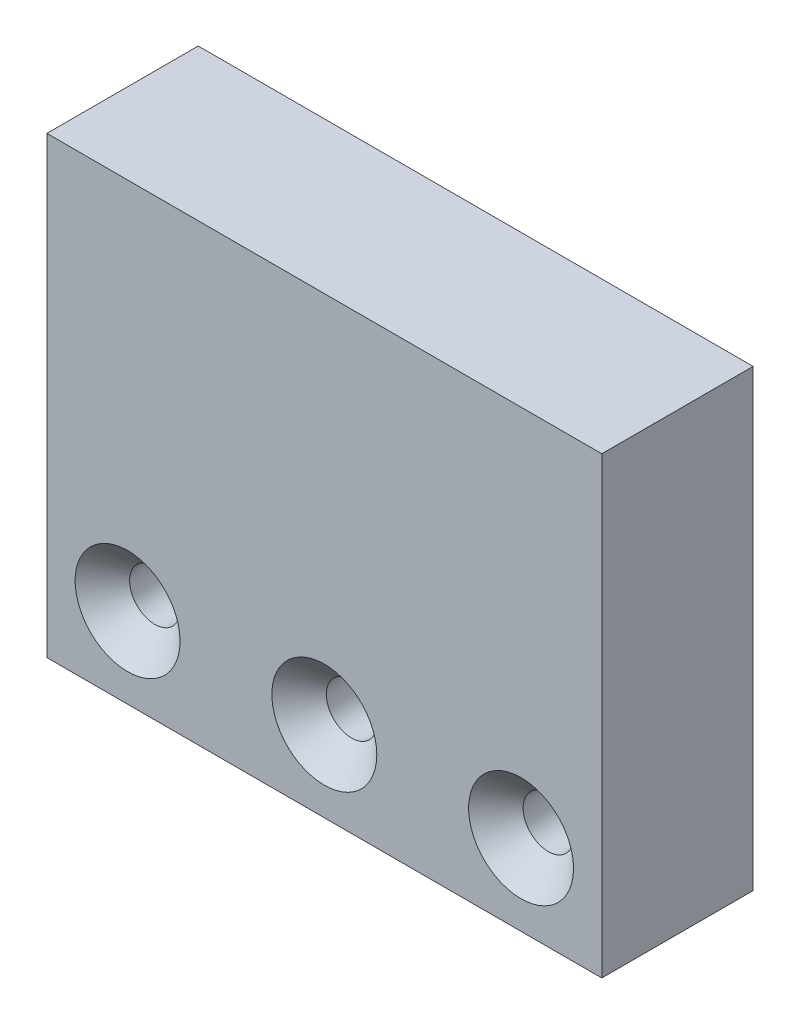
ISO-10303-21;
HEADER;
FILE_DESCRIPTION(('STEP AP214'),'2;1');
FILE_NAME('part.step','',(''),(''),'','','');
FILE_SCHEMA(('AUTOMOTIVE_DESIGN { 1 0 10303 214 1 1 1 1 }'));
ENDSEC;
DATA;
#1=APPLICATION_CONTEXT('core data for automotive mechanical design processes');
#2=APPLICATION_PROTOCOL_DEFINITION('international standard','automotive_design',2000,#1);
#3=PRODUCT_CONTEXT('',#1,'mechanical');
#4=PRODUCT('Part','Part','',(#3));
#5=PRODUCT_RELATED_PRODUCT_CATEGORY('part','',(#4));
#6=PRODUCT_DEFINITION_FORMATION('','',#4);
#7=PRODUCT_DEFINITION_CONTEXT('part definition',#1,'design');
#8=PRODUCT_DEFINITION('design','',#6,#7);
#9=PRODUCT_DEFINITION_SHAPE('','',#8);
#10=(LENGTH_UNIT() NAMED_UNIT(*) SI_UNIT(.MILLI.,.METRE.));
#11=(NAMED_UNIT(*) PLANE_ANGLE_UNIT() SI_UNIT($,.RADIAN.));
#12=(NAMED_UNIT(*) SI_UNIT($,.STERADIAN.) SOLID_ANGLE_UNIT());
#13=UNCERTAINTY_MEASURE_WITH_UNIT(LENGTH_MEASURE(1.E-05),#10,'distance_accuracy_value','');
#14=(GEOMETRIC_REPRESENTATION_CONTEXT(3) GLOBAL_UNCERTAINTY_ASSIGNED_CONTEXT((#13)) GLOBAL_UNIT_ASSIGNED_CONTEXT((#10,
#11,#12)) REPRESENTATION_CONTEXT('',''));
#15=CARTESIAN_POINT('',(0.,0.,0.));
#16=DIRECTION('',(0.,0.,1.));
#17=DIRECTION('',(1.,0.,0.));
#18=AXIS2_PLACEMENT_3D('',#15,#16,#17);
#19=CARTESIAN_POINT('',(27.5,-22.5,15.));
#20=DIRECTION('',(-1.,0.,0.));
#21=DIRECTION('',(0.,0.,1.));
#22=AXIS2_PLACEMENT_3D('',#19,#20,#21);
#23=PLANE('',#22);
#24=DIRECTION('',(0.,1.,0.));
#25=VECTOR('',#24,1.);
#26=CARTESIAN_POINT('',(27.5,-22.5,0.));
#27=LINE('',#26,#25);
#28=CARTESIAN_POINT('',(27.5,-22.5,0.));
#29=VERTEX_POINT('',#28);
#30=CARTESIAN_POINT('',(27.5,22.5,0.));
#31=VERTEX_POINT('',#30);
#32=EDGE_CURVE('E115',#29,#31,#27,.T.);
#33=ORIENTED_EDGE('',*,*,#32,.T.);
#34=DIRECTION('',(0.,0.,-1.));
#35=VECTOR('',#34,1.);
#36=CARTESIAN_POINT('',(27.5,22.5,15.));
#37=LINE('',#36,#35);
#38=CARTESIAN_POINT('',(27.5,22.5,15.));
#39=VERTEX_POINT('',#38);
#40=EDGE_CURVE('E11',#39,#31,#37,.T.);
#41=ORIENTED_EDGE('',*,*,#40,.F.);
#42=DIRECTION('',(0.,1.,0.));
#43=VECTOR('',#42,1.);
#44=CARTESIAN_POINT('',(27.5,-22.5,15.));
#45=LINE('',#44,#43);
#46=CARTESIAN_POINT('',(27.5,-22.5,15.));
#47=VERTEX_POINT('',#46);
#48=EDGE_CURVE('E116',#47,#39,#45,.T.);
#49=ORIENTED_EDGE('',*,*,#48,.F.);
#50=DIRECTION('',(0.,0.,-1.));
#51=VECTOR('',#50,1.);
#52=CARTESIAN_POINT('',(27.5,-22.5,15.));
#53=LINE('',#52,#51);
#54=EDGE_CURVE('E122',#47,#29,#53,.T.);
#55=ORIENTED_EDGE('',*,*,#54,.T.);
#56=EDGE_LOOP('',(#33,#41,#49,#55));
#57=FACE_BOUND('',#56,.T.);
#58=ADVANCED_FACE('F38',(#57),#23,.F.);
#59=CARTESIAN_POINT('',(-27.5,22.5,15.));
#60=DIRECTION('',(0.,-1.,0.));
#61=DIRECTION('',(0.,0.,-1.));
#62=AXIS2_PLACEMENT_3D('',#59,#60,#61);
#63=PLANE('',#62);
#64=DIRECTION('',(-1.,0.,0.));
#65=VECTOR('',#64,1.);
#66=CARTESIAN_POINT('',(-27.5,22.5,0.));
#67=LINE('',#66,#65);
#68=CARTESIAN_POINT('',(-27.5,22.5,0.));
#69=VERTEX_POINT('',#68);
#70=EDGE_CURVE('E125',#31,#69,#67,.T.);
#71=ORIENTED_EDGE('',*,*,#70,.T.);
#72=DIRECTION('',(0.,0.,-1.));
#73=VECTOR('',#72,1.);
#74=CARTESIAN_POINT('',(-27.5,22.5,15.));
#75=LINE('',#74,#73);
#76=CARTESIAN_POINT('',(-27.5,22.5,15.));
#77=VERTEX_POINT('',#76);
#78=EDGE_CURVE('E46',#77,#69,#75,.T.);
#79=ORIENTED_EDGE('',*,*,#78,.F.);
#80=DIRECTION('',(-1.,0.,0.));
#81=VECTOR('',#80,1.);
#82=CARTESIAN_POINT('',(-27.5,22.5,15.));
#83=LINE('',#82,#81);
#84=EDGE_CURVE('E85',#39,#77,#83,.T.);
#85=ORIENTED_EDGE('',*,*,#84,.F.);
#86=ORIENTED_EDGE('',*,*,#40,.T.);
#87=EDGE_LOOP('',(#71,#79,#85,#86));
#88=FACE_BOUND('',#87,.T.);
#89=ADVANCED_FACE('F149',(#88),#63,.F.);
#90=CARTESIAN_POINT('',(-27.5,-22.5,15.));
#91=DIRECTION('',(1.,0.,0.));
#92=DIRECTION('',(0.,0.,-1.));
#93=AXIS2_PLACEMENT_3D('',#90,#91,#92);
#94=PLANE('',#93);
#95=DIRECTION('',(0.,-1.,0.));
#96=VECTOR('',#95,1.);
#97=CARTESIAN_POINT('',(-27.5,-22.5,0.));
#98=LINE('',#97,#96);
#99=CARTESIAN_POINT('',(-27.5,-22.5,0.));
#100=VERTEX_POINT('',#99);
#101=EDGE_CURVE('E72',#69,#100,#98,.T.);
#102=ORIENTED_EDGE('',*,*,#101,.T.);
#103=DIRECTION('',(0.,0.,-1.));
#104=VECTOR('',#103,1.);
#105=CARTESIAN_POINT('',(-27.5,-22.5,15.));
#106=LINE('',#105,#104);
#107=CARTESIAN_POINT('',(-27.5,-22.5,15.));
#108=VERTEX_POINT('',#107);
#109=EDGE_CURVE('E130',#108,#100,#106,.T.);
#110=ORIENTED_EDGE('',*,*,#109,.F.);
#111=DIRECTION('',(0.,-1.,0.));
#112=VECTOR('',#111,1.);
#113=CARTESIAN_POINT('',(-27.5,-22.5,15.));
#114=LINE('',#113,#112);
#115=EDGE_CURVE('E119',#77,#108,#114,.T.);
#116=ORIENTED_EDGE('',*,*,#115,.F.);
#117=ORIENTED_EDGE('',*,*,#78,.T.);
#118=EDGE_LOOP('',(#102,#110,#116,#117));
#119=FACE_BOUND('',#118,.T.);
#120=ADVANCED_FACE('F132',(#119),#94,.F.);
#121=CARTESIAN_POINT('',(-27.5,-22.5,15.));
#122=DIRECTION('',(0.,1.,0.));
#123=DIRECTION('',(0.,0.,1.));
#124=AXIS2_PLACEMENT_3D('',#121,#122,#123);
#125=PLANE('',#124);
#126=DIRECTION('',(1.,0.,0.));
#127=VECTOR('',#126,1.);
#128=CARTESIAN_POINT('',(-27.5,-22.5,0.));
#129=LINE('',#128,#127);
#130=EDGE_CURVE('E78',#100,#29,#129,.T.);
#131=ORIENTED_EDGE('',*,*,#130,.T.);
#132=ORIENTED_EDGE('',*,*,#54,.F.);
#133=DIRECTION('',(1.,0.,0.));
#134=VECTOR('',#133,1.);
#135=CARTESIAN_POINT('',(-27.5,-22.5,15.));
#136=LINE('',#135,#134);
#137=EDGE_CURVE('E54',#108,#47,#136,.T.);
#138=ORIENTED_EDGE('',*,*,#137,.F.);
#139=ORIENTED_EDGE('',*,*,#109,.T.);
#140=EDGE_LOOP('',(#131,#132,#138,#139));
#141=FACE_BOUND('',#140,.T.);
#142=ADVANCED_FACE('F139',(#141),#125,.F.);
#143=CARTESIAN_POINT('',(0.,0.,15.));
#144=DIRECTION('',(0.,0.,-1.));
#145=DIRECTION('',(-1.,0.,0.));
#146=AXIS2_PLACEMENT_3D('',#143,#144,#145);
#147=PLANE('',#146);
#148=CARTESIAN_POINT('',(-19.5,-14.5,15.));
#149=DIRECTION('',(0.,0.,1.));
#150=DIRECTION('',(1.,0.,0.));
#151=AXIS2_PLACEMENT_3D('',#148,#149,#150);
#152=CIRCLE('',#151,5.2);
#153=CARTESIAN_POINT('',(-14.3,-14.5,15.));
#154=VERTEX_POINT('',#153);
#155=EDGE_CURVE('E285',#154,#154,#152,.T.);
#156=ORIENTED_EDGE('',*,*,#155,.F.);
#157=EDGE_LOOP('',(#156));
#158=FACE_BOUND('',#157,.T.);
#159=CARTESIAN_POINT('',(0.,-14.5,15.));
#160=DIRECTION('',(0.,0.,1.));
#161=DIRECTION('',(1.,0.,0.));
#162=AXIS2_PLACEMENT_3D('',#159,#160,#161);
#163=CIRCLE('',#162,5.2);
#164=CARTESIAN_POINT('',(5.2,-14.5,15.));
#165=VERTEX_POINT('',#164);
#166=EDGE_CURVE('E292',#165,#165,#163,.T.);
#167=ORIENTED_EDGE('',*,*,#166,.F.);
#168=EDGE_LOOP('',(#167));
#169=FACE_BOUND('',#168,.T.);
#170=CARTESIAN_POINT('',(19.5,-14.5,15.));
#171=DIRECTION('',(0.,0.,1.));
#172=DIRECTION('',(1.,0.,0.));
#173=AXIS2_PLACEMENT_3D('',#170,#171,#172);
#174=CIRCLE('',#173,5.2);
#175=CARTESIAN_POINT('',(24.7,-14.5,15.));
#176=VERTEX_POINT('',#175);
#177=EDGE_CURVE('E301',#176,#176,#174,.T.);
#178=ORIENTED_EDGE('',*,*,#177,.F.);
#179=EDGE_LOOP('',(#178));
#180=FACE_BOUND('',#179,.T.);
#181=ORIENTED_EDGE('',*,*,#48,.T.);
#182=ORIENTED_EDGE('',*,*,#84,.T.);
#183=ORIENTED_EDGE('',*,*,#115,.T.);
#184=ORIENTED_EDGE('',*,*,#137,.T.);
#185=EDGE_LOOP('',(#181,#182,#183,#184));
#186=FACE_BOUND('',#185,.T.);
#187=ADVANCED_FACE('F141',(#158,#169,#180,#186),#147,.F.);
#188=CARTESIAN_POINT('',(0.,0.,0.));
#189=DIRECTION('',(0.,0.,-1.));
#190=DIRECTION('',(-1.,0.,0.));
#191=AXIS2_PLACEMENT_3D('',#188,#189,#190);
#192=PLANE('',#191);
#193=CARTESIAN_POINT('',(-19.5,-14.5,0.));
#194=DIRECTION('',(0.,0.,1.));
#195=DIRECTION('',(1.,0.,0.));
#196=AXIS2_PLACEMENT_3D('',#193,#194,#195);
#197=CIRCLE('',#196,2.5);
#198=CARTESIAN_POINT('',(-17.,-14.5,0.));
#199=VERTEX_POINT('',#198);
#200=EDGE_CURVE('E287',#199,#199,#197,.T.);
#201=ORIENTED_EDGE('',*,*,#200,.T.);
#202=EDGE_LOOP('',(#201));
#203=FACE_BOUND('',#202,.T.);
#204=CARTESIAN_POINT('',(0.,-14.5,0.));
#205=DIRECTION('',(0.,0.,1.));
#206=DIRECTION('',(1.,0.,0.));
#207=AXIS2_PLACEMENT_3D('',#204,#205,#206);
#208=CIRCLE('',#207,2.5);
#209=CARTESIAN_POINT('',(2.5,-14.5,0.));
#210=VERTEX_POINT('',#209);
#211=EDGE_CURVE('E298',#210,#210,#208,.T.);
#212=ORIENTED_EDGE('',*,*,#211,.T.);
#213=EDGE_LOOP('',(#212));
#214=FACE_BOUND('',#213,.T.);
#215=CARTESIAN_POINT('',(19.5,-14.5,0.));
#216=DIRECTION('',(0.,0.,1.));
#217=DIRECTION('',(1.,0.,0.));
#218=AXIS2_PLACEMENT_3D('',#215,#216,#217);
#219=CIRCLE('',#218,2.5);
#220=CARTESIAN_POINT('',(22.,-14.5,0.));
#221=VERTEX_POINT('',#220);
#222=EDGE_CURVE('E109',#221,#221,#219,.T.);
#223=ORIENTED_EDGE('',*,*,#222,.T.);
#224=EDGE_LOOP('',(#223));
#225=FACE_BOUND('',#224,.T.);
#226=CARTESIAN_POINT('',(15.5,13.5,0.));
#227=DIRECTION('',(0.,0.,-1.));
#228=DIRECTION('',(-1.,0.,0.));
#229=AXIS2_PLACEMENT_3D('',#226,#227,#228);
#230=CIRCLE('',#229,2.1);
#231=CARTESIAN_POINT('',(13.4,13.5,0.));
#232=VERTEX_POINT('',#231);
#233=EDGE_CURVE('E103',#232,#232,#230,.T.);
#234=ORIENTED_EDGE('',*,*,#233,.F.);
#235=EDGE_LOOP('',(#234));
#236=FACE_BOUND('',#235,.T.);
#237=CARTESIAN_POINT('',(-15.5,13.5,0.));
#238=DIRECTION('',(0.,0.,-1.));
#239=DIRECTION('',(-1.,0.,0.));
#240=AXIS2_PLACEMENT_3D('',#237,#238,#239);
#241=CIRCLE('',#240,2.1);
#242=CARTESIAN_POINT('',(-17.6,13.5,0.));
#243=VERTEX_POINT('',#242);
#244=EDGE_CURVE('E102',#243,#243,#241,.T.);
#245=ORIENTED_EDGE('',*,*,#244,.F.);
#246=EDGE_LOOP('',(#245));
#247=FACE_BOUND('',#246,.T.);
#248=ORIENTED_EDGE('',*,*,#32,.F.);
#249=ORIENTED_EDGE('',*,*,#130,.F.);
#250=ORIENTED_EDGE('',*,*,#101,.F.);
#251=ORIENTED_EDGE('',*,*,#70,.F.);
#252=EDGE_LOOP('',(#248,#249,#250,#251));
#253=FACE_BOUND('',#252,.T.);
#254=ADVANCED_FACE('F135',(#203,#214,#225,#236,#247,#253),#192,.T.);
#255=CARTESIAN_POINT('',(-15.5,13.5,10.));
#256=DIRECTION('',(0.,0.,-1.));
#257=DIRECTION('',(-1.,0.,0.));
#258=AXIS2_PLACEMENT_3D('',#255,#256,#257);
#259=CONICAL_SURFACE('',#258,2.1,1.02974425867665);
#260=CARTESIAN_POINT('',(-15.5,13.5,11.2618072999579));
#261=VERTEX_POINT('',#260);
#262=VERTEX_LOOP('',#261);
#263=FACE_BOUND('',#262,.T.);
#264=CARTESIAN_POINT('',(-15.5,13.5,10.));
#265=DIRECTION('',(0.,0.,-1.));
#266=DIRECTION('',(-1.,0.,0.));
#267=AXIS2_PLACEMENT_3D('',#264,#265,#266);
#268=CIRCLE('',#267,2.1);
#269=CARTESIAN_POINT('',(-17.6,13.5,10.));
#270=VERTEX_POINT('',#269);
#271=EDGE_CURVE('E106',#270,#270,#268,.T.);
#272=ORIENTED_EDGE('',*,*,#271,.T.);
#273=EDGE_LOOP('',(#272));
#274=FACE_BOUND('',#273,.T.);
#275=ADVANCED_FACE('F172',(#263,#274),#259,.F.);
#276=CARTESIAN_POINT('',(-15.5,13.5,0.));
#277=DIRECTION('',(0.,0.,-1.));
#278=DIRECTION('',(-1.,0.,0.));
#279=AXIS2_PLACEMENT_3D('',#276,#277,#278);
#280=CYLINDRICAL_SURFACE('',#279,2.1);
#281=ORIENTED_EDGE('',*,*,#271,.F.);
#282=EDGE_LOOP('',(#281));
#283=FACE_BOUND('',#282,.T.);
#284=ORIENTED_EDGE('',*,*,#244,.T.);
#285=EDGE_LOOP('',(#284));
#286=FACE_BOUND('',#285,.T.);
#287=ADVANCED_FACE('F96',(#283,#286),#280,.F.);
#288=CARTESIAN_POINT('',(15.5,13.5,10.));
#289=DIRECTION('',(0.,0.,-1.));
#290=DIRECTION('',(-1.,0.,0.));
#291=AXIS2_PLACEMENT_3D('',#288,#289,#290);
#292=CONICAL_SURFACE('',#291,2.1,1.02974425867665);
#293=CARTESIAN_POINT('',(15.5,13.5,11.2618072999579));
#294=VERTEX_POINT('',#293);
#295=VERTEX_LOOP('',#294);
#296=FACE_BOUND('',#295,.T.);
#297=CARTESIAN_POINT('',(15.5,13.5,10.));
#298=DIRECTION('',(0.,0.,-1.));
#299=DIRECTION('',(-1.,0.,0.));
#300=AXIS2_PLACEMENT_3D('',#297,#298,#299);
#301=CIRCLE('',#300,2.1);
#302=CARTESIAN_POINT('',(13.4,13.5,10.));
#303=VERTEX_POINT('',#302);
#304=EDGE_CURVE('E100',#303,#303,#301,.T.);
#305=ORIENTED_EDGE('',*,*,#304,.T.);
#306=EDGE_LOOP('',(#305));
#307=FACE_BOUND('',#306,.T.);
#308=ADVANCED_FACE('F92',(#296,#307),#292,.F.);
#309=CARTESIAN_POINT('',(15.5,13.5,0.));
#310=DIRECTION('',(0.,0.,-1.));
#311=DIRECTION('',(-1.,0.,0.));
#312=AXIS2_PLACEMENT_3D('',#309,#310,#311);
#313=CYLINDRICAL_SURFACE('',#312,2.1);
#314=ORIENTED_EDGE('',*,*,#304,.F.);
#315=EDGE_LOOP('',(#314));
#316=FACE_BOUND('',#315,.T.);
#317=ORIENTED_EDGE('',*,*,#233,.T.);
#318=EDGE_LOOP('',(#317));
#319=FACE_BOUND('',#318,.T.);
#320=ADVANCED_FACE('F95',(#316,#319),#313,.F.);
#321=CARTESIAN_POINT('',(19.5,-14.5,15.));
#322=DIRECTION('',(0.,0.,1.));
#323=DIRECTION('',(1.,0.,0.));
#324=AXIS2_PLACEMENT_3D('',#321,#322,#323);
#325=CYLINDRICAL_SURFACE('',#324,2.5);
#326=ORIENTED_EDGE('',*,*,#222,.F.);
#327=EDGE_LOOP('',(#326));
#328=FACE_BOUND('',#327,.T.);
#329=CARTESIAN_POINT('',(19.5,-14.5,12.3));
#330=DIRECTION('',(0.,0.,1.));
#331=DIRECTION('',(1.,0.,0.));
#332=AXIS2_PLACEMENT_3D('',#329,#330,#331);
#333=CIRCLE('',#332,2.5);
#334=CARTESIAN_POINT('',(22.,-14.5,12.3));
#335=VERTEX_POINT('',#334);
#336=EDGE_CURVE('E304',#335,#335,#333,.T.);
#337=ORIENTED_EDGE('',*,*,#336,.T.);
#338=EDGE_LOOP('',(#337));
#339=FACE_BOUND('',#338,.T.);
#340=ADVANCED_FACE('F205',(#328,#339),#325,.F.);
#341=CARTESIAN_POINT('',(19.5,-14.5,15.));
#342=DIRECTION('',(0.,0.,1.));
#343=DIRECTION('',(1.,0.,0.));
#344=AXIS2_PLACEMENT_3D('',#341,#342,#343);
#345=CONICAL_SURFACE('',#344,5.2,0.785398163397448);
#346=ORIENTED_EDGE('',*,*,#336,.F.);
#347=EDGE_LOOP('',(#346));
#348=FACE_BOUND('',#347,.T.);
#349=ORIENTED_EDGE('',*,*,#177,.T.);
#350=EDGE_LOOP('',(#349));
#351=FACE_BOUND('',#350,.T.);
#352=ADVANCED_FACE('F225',(#348,#351),#345,.F.);
#353=CARTESIAN_POINT('',(0.,-14.5,15.));
#354=DIRECTION('',(0.,0.,1.));
#355=DIRECTION('',(1.,0.,0.));
#356=AXIS2_PLACEMENT_3D('',#353,#354,#355);
#357=CYLINDRICAL_SURFACE('',#356,2.5);
#358=ORIENTED_EDGE('',*,*,#211,.F.);
#359=EDGE_LOOP('',(#358));
#360=FACE_BOUND('',#359,.T.);
#361=CARTESIAN_POINT('',(0.,-14.5,12.3));
#362=DIRECTION('',(0.,0.,1.));
#363=DIRECTION('',(1.,0.,0.));
#364=AXIS2_PLACEMENT_3D('',#361,#362,#363);
#365=CIRCLE('',#364,2.5);
#366=CARTESIAN_POINT('',(2.5,-14.5,12.3));
#367=VERTEX_POINT('',#366);
#368=EDGE_CURVE('E295',#367,#367,#365,.T.);
#369=ORIENTED_EDGE('',*,*,#368,.T.);
#370=EDGE_LOOP('',(#369));
#371=FACE_BOUND('',#370,.T.);
#372=ADVANCED_FACE('F235',(#360,#371),#357,.F.);
#373=CARTESIAN_POINT('',(0.,-14.5,15.));
#374=DIRECTION('',(0.,0.,1.));
#375=DIRECTION('',(1.,0.,0.));
#376=AXIS2_PLACEMENT_3D('',#373,#374,#375);
#377=CONICAL_SURFACE('',#376,5.2,0.785398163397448);
#378=ORIENTED_EDGE('',*,*,#368,.F.);
#379=EDGE_LOOP('',(#378));
#380=FACE_BOUND('',#379,.T.);
#381=ORIENTED_EDGE('',*,*,#166,.T.);
#382=EDGE_LOOP('',(#381));
#383=FACE_BOUND('',#382,.T.);
#384=ADVANCED_FACE('F245',(#380,#383),#377,.F.);
#385=CARTESIAN_POINT('',(-19.5,-14.5,15.));
#386=DIRECTION('',(0.,0.,1.));
#387=DIRECTION('',(1.,0.,0.));
#388=AXIS2_PLACEMENT_3D('',#385,#386,#387);
#389=CYLINDRICAL_SURFACE('',#388,2.5);
#390=ORIENTED_EDGE('',*,*,#200,.F.);
#391=EDGE_LOOP('',(#390));
#392=FACE_BOUND('',#391,.T.);
#393=CARTESIAN_POINT('',(-19.5,-14.5,12.3));
#394=DIRECTION('',(0.,0.,1.));
#395=DIRECTION('',(1.,0.,0.));
#396=AXIS2_PLACEMENT_3D('',#393,#394,#395);
#397=CIRCLE('',#396,2.5);
#398=CARTESIAN_POINT('',(-17.,-14.5,12.3));
#399=VERTEX_POINT('',#398);
#400=EDGE_CURVE('E282',#399,#399,#397,.T.);
#401=ORIENTED_EDGE('',*,*,#400,.T.);
#402=EDGE_LOOP('',(#401));
#403=FACE_BOUND('',#402,.T.);
#404=ADVANCED_FACE('F255',(#392,#403),#389,.F.);
#405=CARTESIAN_POINT('',(-19.5,-14.5,15.));
#406=DIRECTION('',(0.,0.,1.));
#407=DIRECTION('',(1.,0.,0.));
#408=AXIS2_PLACEMENT_3D('',#405,#406,#407);
#409=CONICAL_SURFACE('',#408,5.2,0.785398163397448);
#410=ORIENTED_EDGE('',*,*,#400,.F.);
#411=EDGE_LOOP('',(#410));
#412=FACE_BOUND('',#411,.T.);
#413=ORIENTED_EDGE('',*,*,#155,.T.);
#414=EDGE_LOOP('',(#413));
#415=FACE_BOUND('',#414,.T.);
#416=ADVANCED_FACE('F265',(#412,#415),#409,.F.);
#417=CLOSED_SHELL('',(#58,#89,#120,#142,#187,#254,#275,#287,#308,#320,#340,#352,#372,#384,#404,#416));
#418=MANIFOLD_SOLID_BREP('B2',#417);
#419=ADVANCED_BREP_SHAPE_REPRESENTATION('',(#18,#418),#14);
#420=SHAPE_DEFINITION_REPRESENTATION(#9,#419);
ENDSEC;
END-ISO-10303-21;
